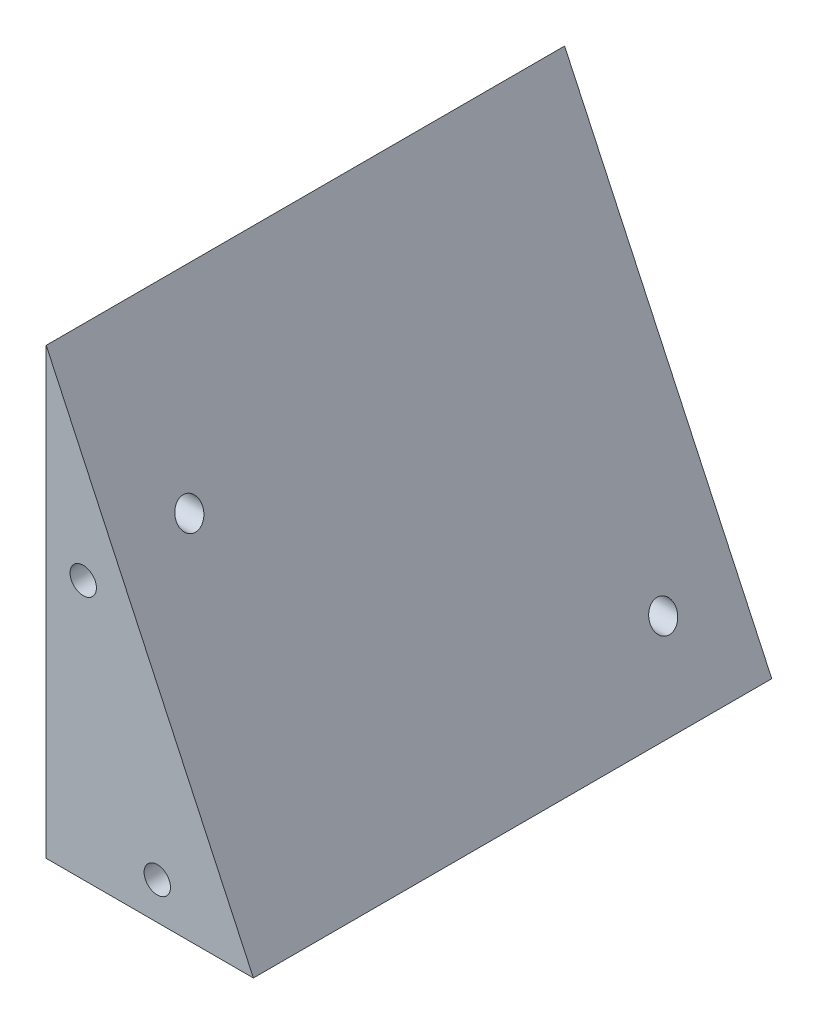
from build123d import *

# Parameters (mm, degrees)
EXTRUDE1_DEPTH            = 44.45
F_4_40_TAPPED_HOLE1_D     = 2.2606
F_4_40_TAPPED_HOLE2_D     = 2.2606
F_4_40_TAPPED_HOLE2_DEPTH = 12.7
F_4_40_TAPPED_HOLE2_TIP   = 0.679152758


with BuildPart() as part:
    # Sketch1 → Extrude1 (new body)
    with BuildSketch(Plane.XY):
        Polygon((0, 0), (0, 38.1), (17.766321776, 0), align=None)
    extrude(amount=EXTRUDE1_DEPTH)

    # 4-40 Tapped Hole1 (through all)
    with Locations(Plane(origin=(0, 6.35, 6.35), x_dir=(0, 0, -1), z_dir=(-1, 0, 0))):
        with Locations((0, 0), (-31.75, -19.05)):
            Hole(F_4_40_TAPPED_HOLE1_D / 2)

    # 4-40 Tapped Hole2
    with Locations(Plane(origin=(3.175, 22.225, 44.45), x_dir=(1, 0, 0), z_dir=(0, 0, 1))):
        with Locations((0, 0), (6.35, -19.05)):
            Hole(F_4_40_TAPPED_HOLE2_D / 2, depth=F_4_40_TAPPED_HOLE2_DEPTH)
            with Locations((0, 0, -(F_4_40_TAPPED_HOLE2_DEPTH + F_4_40_TAPPED_HOLE2_TIP / 2))):  # 118° drill point
                Cone(0, F_4_40_TAPPED_HOLE2_D / 2, F_4_40_TAPPED_HOLE2_TIP, mode=Mode.SUBTRACT)


solid = part.part
